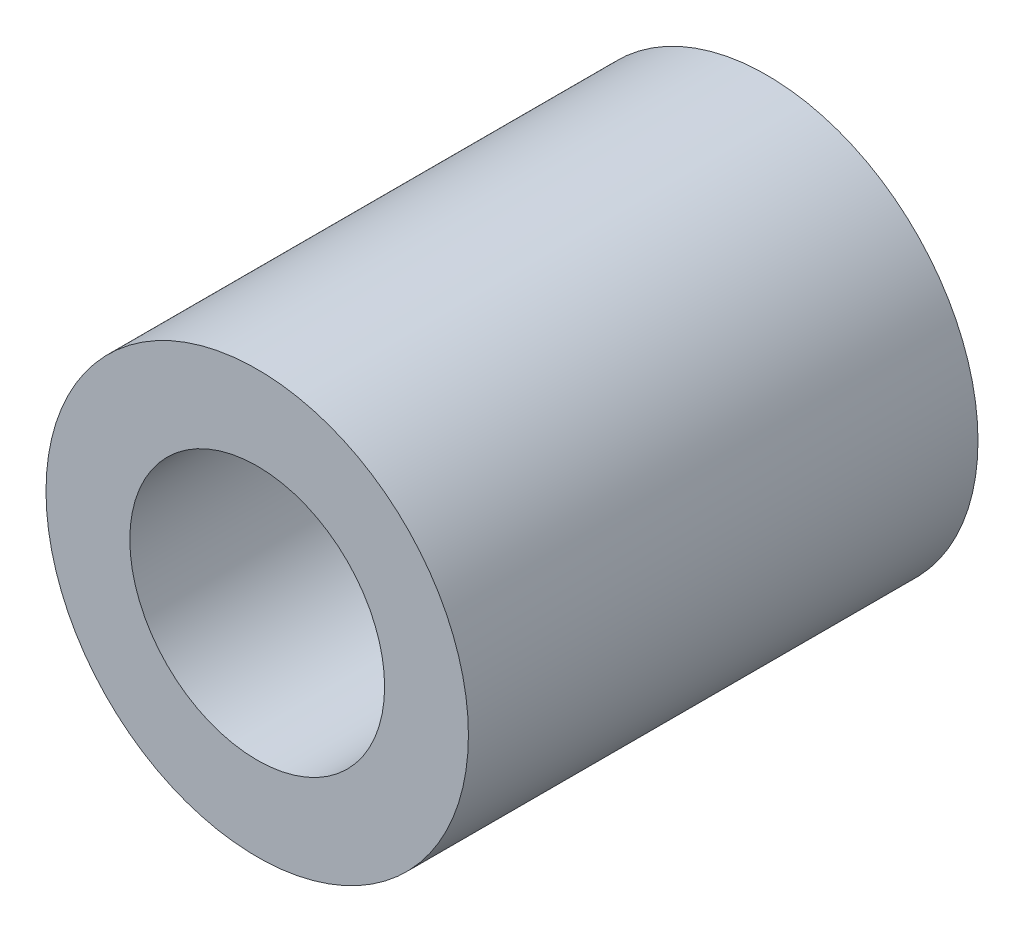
ISO-10303-21;
HEADER;
FILE_DESCRIPTION(('STEP AP214'),'2;1');
FILE_NAME('part.step','',(''),(''),'','','');
FILE_SCHEMA(('AUTOMOTIVE_DESIGN { 1 0 10303 214 1 1 1 1 }'));
ENDSEC;
DATA;
#1=APPLICATION_CONTEXT('core data for automotive mechanical design processes');
#2=APPLICATION_PROTOCOL_DEFINITION('international standard','automotive_design',2000,#1);
#3=PRODUCT_CONTEXT('',#1,'mechanical');
#4=PRODUCT('Part','Part','',(#3));
#5=PRODUCT_RELATED_PRODUCT_CATEGORY('part','',(#4));
#6=PRODUCT_DEFINITION_FORMATION('','',#4);
#7=PRODUCT_DEFINITION_CONTEXT('part definition',#1,'design');
#8=PRODUCT_DEFINITION('design','',#6,#7);
#9=PRODUCT_DEFINITION_SHAPE('','',#8);
#10=(LENGTH_UNIT() NAMED_UNIT(*) SI_UNIT(.MILLI.,.METRE.));
#11=(NAMED_UNIT(*) PLANE_ANGLE_UNIT() SI_UNIT($,.RADIAN.));
#12=(NAMED_UNIT(*) SI_UNIT($,.STERADIAN.) SOLID_ANGLE_UNIT());
#13=UNCERTAINTY_MEASURE_WITH_UNIT(LENGTH_MEASURE(1.E-05),#10,'distance_accuracy_value','');
#14=(GEOMETRIC_REPRESENTATION_CONTEXT(3) GLOBAL_UNCERTAINTY_ASSIGNED_CONTEXT((#13)) GLOBAL_UNIT_ASSIGNED_CONTEXT((#10,
#11,#12)) REPRESENTATION_CONTEXT('',''));
#15=CARTESIAN_POINT('',(0.,0.,0.));
#16=DIRECTION('',(0.,0.,1.));
#17=DIRECTION('',(1.,0.,0.));
#18=AXIS2_PLACEMENT_3D('',#15,#16,#17);
#19=CARTESIAN_POINT('',(0.,0.,76.));
#20=DIRECTION('',(0.,0.,1.));
#21=DIRECTION('',(1.,0.,0.));
#22=AXIS2_PLACEMENT_3D('',#19,#20,#21);
#23=PLANE('',#22);
#24=CARTESIAN_POINT('',(0.,0.,76.));
#25=DIRECTION('',(0.,0.,1.));
#26=DIRECTION('',(1.,0.,0.));
#27=AXIS2_PLACEMENT_3D('',#24,#25,#26);
#28=CIRCLE('',#27,31.5);
#29=CARTESIAN_POINT('',(31.5,0.,76.));
#30=VERTEX_POINT('',#29);
#31=EDGE_CURVE('E9',#30,#30,#28,.T.);
#32=ORIENTED_EDGE('',*,*,#31,.T.);
#33=EDGE_LOOP('',(#32));
#34=FACE_BOUND('',#33,.T.);
#35=CARTESIAN_POINT('',(0.,0.,76.));
#36=DIRECTION('',(0.,0.,1.));
#37=DIRECTION('',(1.,0.,0.));
#38=AXIS2_PLACEMENT_3D('',#35,#36,#37);
#39=CIRCLE('',#38,19.);
#40=CARTESIAN_POINT('',(19.,0.,76.));
#41=VERTEX_POINT('',#40);
#42=EDGE_CURVE('E25',#41,#41,#39,.T.);
#43=ORIENTED_EDGE('',*,*,#42,.F.);
#44=EDGE_LOOP('',(#43));
#45=FACE_BOUND('',#44,.T.);
#46=ADVANCED_FACE('F14',(#34,#45),#23,.T.);
#47=CARTESIAN_POINT('',(0.,0.,0.));
#48=DIRECTION('',(0.,0.,1.));
#49=DIRECTION('',(1.,0.,0.));
#50=AXIS2_PLACEMENT_3D('',#47,#48,#49);
#51=PLANE('',#50);
#52=CARTESIAN_POINT('',(0.,0.,0.));
#53=DIRECTION('',(0.,0.,1.));
#54=DIRECTION('',(1.,0.,0.));
#55=AXIS2_PLACEMENT_3D('',#52,#53,#54);
#56=CIRCLE('',#55,31.5);
#57=CARTESIAN_POINT('',(31.5,0.,0.));
#58=VERTEX_POINT('',#57);
#59=EDGE_CURVE('E18',#58,#58,#56,.T.);
#60=ORIENTED_EDGE('',*,*,#59,.F.);
#61=EDGE_LOOP('',(#60));
#62=FACE_BOUND('',#61,.T.);
#63=CARTESIAN_POINT('',(0.,0.,0.));
#64=DIRECTION('',(0.,0.,1.));
#65=DIRECTION('',(1.,0.,0.));
#66=AXIS2_PLACEMENT_3D('',#63,#64,#65);
#67=CIRCLE('',#66,19.);
#68=CARTESIAN_POINT('',(19.,0.,0.));
#69=VERTEX_POINT('',#68);
#70=EDGE_CURVE('E27',#69,#69,#67,.T.);
#71=ORIENTED_EDGE('',*,*,#70,.T.);
#72=EDGE_LOOP('',(#71));
#73=FACE_BOUND('',#72,.T.);
#74=ADVANCED_FACE('F37',(#62,#73),#51,.F.);
#75=CARTESIAN_POINT('',(0.,0.,76.));
#76=DIRECTION('',(0.,0.,-1.));
#77=DIRECTION('',(-1.,0.,0.));
#78=AXIS2_PLACEMENT_3D('',#75,#76,#77);
#79=CYLINDRICAL_SURFACE('',#78,31.5);
#80=ORIENTED_EDGE('',*,*,#31,.F.);
#81=EDGE_LOOP('',(#80));
#82=FACE_BOUND('',#81,.T.);
#83=ORIENTED_EDGE('',*,*,#59,.T.);
#84=EDGE_LOOP('',(#83));
#85=FACE_BOUND('',#84,.T.);
#86=ADVANCED_FACE('F16',(#82,#85),#79,.T.);
#87=CARTESIAN_POINT('',(0.,0.,76.));
#88=DIRECTION('',(0.,0.,-1.));
#89=DIRECTION('',(-1.,0.,0.));
#90=AXIS2_PLACEMENT_3D('',#87,#88,#89);
#91=CYLINDRICAL_SURFACE('',#90,19.);
#92=ORIENTED_EDGE('',*,*,#42,.T.);
#93=EDGE_LOOP('',(#92));
#94=FACE_BOUND('',#93,.T.);
#95=ORIENTED_EDGE('',*,*,#70,.F.);
#96=EDGE_LOOP('',(#95));
#97=FACE_BOUND('',#96,.T.);
#98=ADVANCED_FACE('F33',(#94,#97),#91,.F.);
#99=CLOSED_SHELL('',(#46,#74,#86,#98));
#100=MANIFOLD_SOLID_BREP('B1',#99);
#101=ADVANCED_BREP_SHAPE_REPRESENTATION('',(#18,#100),#14);
#102=SHAPE_DEFINITION_REPRESENTATION(#9,#101);
ENDSEC;
END-ISO-10303-21;
